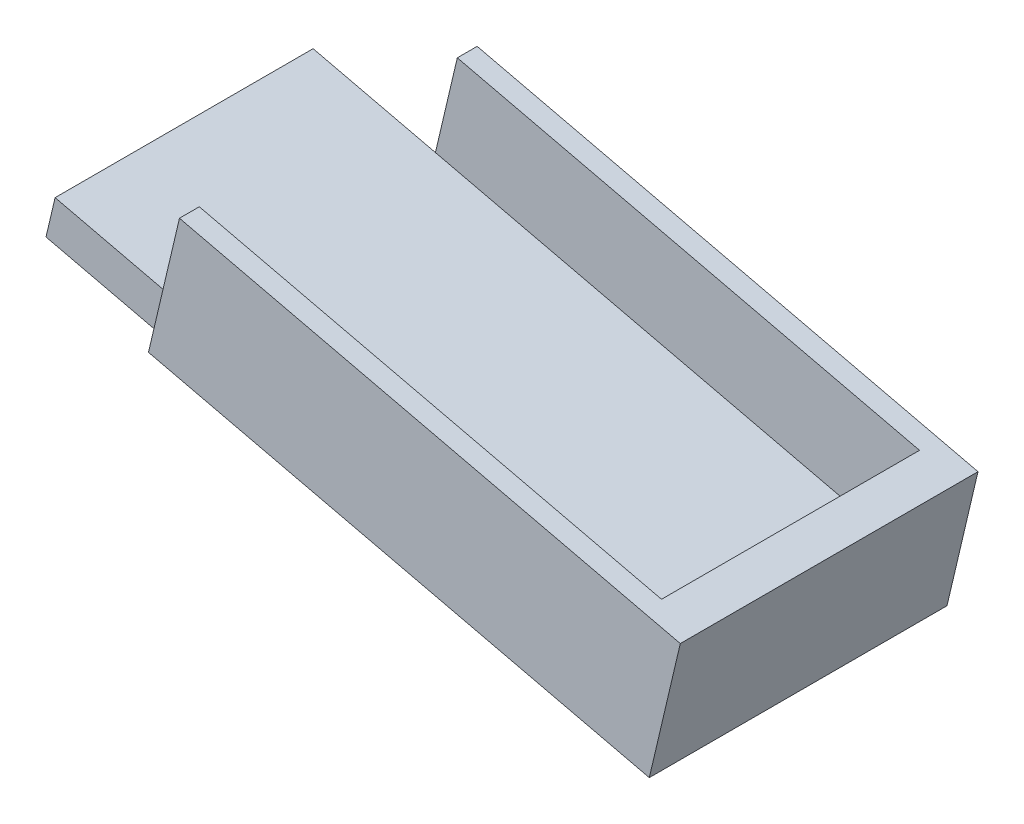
from build123d import *

# Parameters (mm, degrees)
EXTRUDE_THIN1_DEPTH = 65
BOSS_EXTRUDE1_DEPTH = 5
BOSS_EXTRUDE2_DEPTH = 5


with BuildPart() as part:
    # Sketch1 → Extrude-Thin1 (new body)
    with BuildSketch(Plane.XY):
        Polygon((-0.811545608, -33.517491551), (146.446444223, -68.190795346), (151.963125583, -44.761375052), (161.696938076, -47.053294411), (153.888337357, -80.216527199), (-3.103464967, -43.251304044), align=None)
    extrude(amount=EXTRUDE_THIN1_DEPTH)

    # Sketch2 → Boss-Extrude1 (add)
    with BuildSketch(Plane.XY.offset(65)):
        Polygon((161.696938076, -47.053294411), (153.888337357, -80.216527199), (27.711687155, -50.507026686), (35.520287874, -17.343793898), align=None)
    extrude(amount=BOSS_EXTRUDE1_DEPTH)

    # Sketch3 → Boss-Extrude2 (add)
    with BuildSketch(Plane(origin=(0, 0, 0), x_dir=(-1, 0, 0), z_dir=(0, 0, -1))):
        Polygon((-161.696938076, -47.053294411), (-35.520287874, -17.343793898), (-27.711687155, -50.507026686), (-153.888337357, -80.216527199), align=None)
    extrude(amount=BOSS_EXTRUDE2_DEPTH)


solid = part.part
